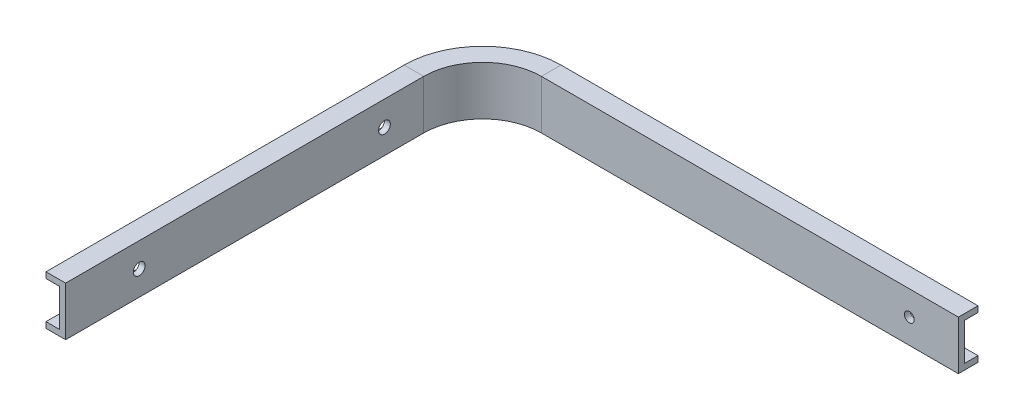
ISO-10303-21;
HEADER;
FILE_DESCRIPTION(('STEP AP214'),'2;1');
FILE_NAME('part.step','',(''),(''),'','','');
FILE_SCHEMA(('AUTOMOTIVE_DESIGN { 1 0 10303 214 1 1 1 1 }'));
ENDSEC;
DATA;
#1=APPLICATION_CONTEXT('core data for automotive mechanical design processes');
#2=APPLICATION_PROTOCOL_DEFINITION('international standard','automotive_design',2000,#1);
#3=PRODUCT_CONTEXT('',#1,'mechanical');
#4=PRODUCT('Part','Part','',(#3));
#5=PRODUCT_RELATED_PRODUCT_CATEGORY('part','',(#4));
#6=PRODUCT_DEFINITION_FORMATION('','',#4);
#7=PRODUCT_DEFINITION_CONTEXT('part definition',#1,'design');
#8=PRODUCT_DEFINITION('design','',#6,#7);
#9=PRODUCT_DEFINITION_SHAPE('','',#8);
#10=(LENGTH_UNIT() NAMED_UNIT(*) SI_UNIT(.MILLI.,.METRE.));
#11=(NAMED_UNIT(*) PLANE_ANGLE_UNIT() SI_UNIT($,.RADIAN.));
#12=(NAMED_UNIT(*) SI_UNIT($,.STERADIAN.) SOLID_ANGLE_UNIT());
#13=UNCERTAINTY_MEASURE_WITH_UNIT(LENGTH_MEASURE(1.E-05),#10,'distance_accuracy_value','');
#14=(GEOMETRIC_REPRESENTATION_CONTEXT(3) GLOBAL_UNCERTAINTY_ASSIGNED_CONTEXT((#13)) GLOBAL_UNIT_ASSIGNED_CONTEXT((#10,
#11,#12)) REPRESENTATION_CONTEXT('',''));
#15=CARTESIAN_POINT('',(0.,0.,0.));
#16=DIRECTION('',(0.,0.,1.));
#17=DIRECTION('',(1.,0.,0.));
#18=AXIS2_PLACEMENT_3D('',#15,#16,#17);
#19=CARTESIAN_POINT('',(-252.51106428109,-12.4999999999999,-227.488935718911));
#20=DIRECTION('',(-1.,0.,0.));
#21=DIRECTION('',(0.,0.,1.));
#22=AXIS2_PLACEMENT_3D('',#19,#20,#21);
#23=PLANE('',#22);
#24=DIRECTION('',(0.,-1.,0.));
#25=VECTOR('',#24,1.);
#26=CARTESIAN_POINT('',(-252.511064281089,12.5,222.511064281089));
#27=LINE('',#26,#25);
#28=CARTESIAN_POINT('',(-252.511064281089,-9.5,222.511064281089));
#29=VERTEX_POINT('',#28);
#30=CARTESIAN_POINT('',(-252.511064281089,-12.5,222.511064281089));
#31=VERTEX_POINT('',#30);
#32=EDGE_CURVE('E190',#29,#31,#27,.T.);
#33=ORIENTED_EDGE('',*,*,#32,.F.);
#34=DIRECTION('',(0.,0.,1.));
#35=VECTOR('',#34,1.);
#36=CARTESIAN_POINT('',(-252.511064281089,-9.5,40.0000000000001));
#37=LINE('',#36,#35);
#38=CARTESIAN_POINT('',(-252.511064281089,-9.5,40.0000000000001));
#39=VERTEX_POINT('',#38);
#40=EDGE_CURVE('E331',#39,#29,#37,.T.);
#41=ORIENTED_EDGE('',*,*,#40,.F.);
#42=DIRECTION('',(0.,-1.,0.));
#43=VECTOR('',#42,1.);
#44=CARTESIAN_POINT('',(-252.511064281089,-12.4999999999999,40.0000000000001));
#45=LINE('',#44,#43);
#46=CARTESIAN_POINT('',(-252.511064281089,-12.5,40.0000000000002));
#47=VERTEX_POINT('',#46);
#48=EDGE_CURVE('E43',#39,#47,#45,.T.);
#49=ORIENTED_EDGE('',*,*,#48,.T.);
#50=DIRECTION('',(0.,0.,-1.));
#51=VECTOR('',#50,1.);
#52=CARTESIAN_POINT('',(-252.51106428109,-12.4999999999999,-227.488935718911));
#53=LINE('',#52,#51);
#54=EDGE_CURVE('E189',#31,#47,#53,.T.);
#55=ORIENTED_EDGE('',*,*,#54,.F.);
#56=EDGE_LOOP('',(#33,#41,#49,#55));
#57=FACE_BOUND('',#56,.T.);
#58=ADVANCED_FACE('F34',(#57),#23,.T.);
#59=CARTESIAN_POINT('',(0.,-12.4999999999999,0.));
#60=DIRECTION('',(0.,0.,-1.));
#61=DIRECTION('',(-1.,0.,0.));
#62=AXIS2_PLACEMENT_3D('',#59,#60,#61);
#63=PLANE('',#62);
#64=DIRECTION('',(0.,-1.,0.));
#65=VECTOR('',#64,1.);
#66=CARTESIAN_POINT('',(-212.511064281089,-12.4999999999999,0.));
#67=LINE('',#66,#65);
#68=CARTESIAN_POINT('',(-212.511064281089,-9.50000000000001,0.));
#69=VERTEX_POINT('',#68);
#70=CARTESIAN_POINT('',(-212.511064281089,-12.5,0.));
#71=VERTEX_POINT('',#70);
#72=EDGE_CURVE('E165',#69,#71,#67,.T.);
#73=ORIENTED_EDGE('',*,*,#72,.F.);
#74=DIRECTION('',(-1.,0.,0.));
#75=VECTOR('',#74,1.);
#76=CARTESIAN_POINT('',(0.,-9.5,0.));
#77=LINE('',#76,#75);
#78=CARTESIAN_POINT('',(0.,-9.5,0.));
#79=VERTEX_POINT('',#78);
#80=EDGE_CURVE('E51',#79,#69,#77,.T.);
#81=ORIENTED_EDGE('',*,*,#80,.F.);
#82=DIRECTION('',(0.,1.,0.));
#83=VECTOR('',#82,1.);
#84=CARTESIAN_POINT('',(0.,12.4999999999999,0.));
#85=LINE('',#84,#83);
#86=CARTESIAN_POINT('',(0.,-12.4999999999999,0.));
#87=VERTEX_POINT('',#86);
#88=EDGE_CURVE('E164',#87,#79,#85,.T.);
#89=ORIENTED_EDGE('',*,*,#88,.F.);
#90=DIRECTION('',(1.,0.,0.));
#91=VECTOR('',#90,1.);
#92=CARTESIAN_POINT('',(0.,-12.4999999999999,0.));
#93=LINE('',#92,#91);
#94=EDGE_CURVE('E257',#71,#87,#93,.T.);
#95=ORIENTED_EDGE('',*,*,#94,.F.);
#96=EDGE_LOOP('',(#73,#81,#89,#95));
#97=FACE_BOUND('',#96,.T.);
#98=ADVANCED_FACE('F162',(#97),#63,.T.);
#99=CARTESIAN_POINT('',(-212.511064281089,463.304835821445,40.));
#100=DIRECTION('',(0.,-1.,0.));
#101=DIRECTION('',(0.,0.,-1.));
#102=AXIS2_PLACEMENT_3D('',#99,#100,#101);
#103=CYLINDRICAL_SURFACE('',#102,40.);
#104=ORIENTED_EDGE('',*,*,#48,.F.);
#105=CARTESIAN_POINT('',(-212.511064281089,-9.5,40.));
#106=DIRECTION('',(0.,1.,0.));
#107=DIRECTION('',(0.,0.,1.));
#108=AXIS2_PLACEMENT_3D('',#105,#106,#107);
#109=CIRCLE('',#108,40.);
#110=EDGE_CURVE('E166',#69,#39,#109,.T.);
#111=ORIENTED_EDGE('',*,*,#110,.F.);
#112=ORIENTED_EDGE('',*,*,#72,.T.);
#113=CARTESIAN_POINT('',(-212.511064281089,-12.5,40.));
#114=DIRECTION('',(0.,-1.,0.));
#115=DIRECTION('',(0.,0.,-1.));
#116=AXIS2_PLACEMENT_3D('',#113,#114,#115);
#117=CIRCLE('',#116,40.);
#118=EDGE_CURVE('E238',#47,#71,#117,.T.);
#119=ORIENTED_EDGE('',*,*,#118,.F.);
#120=EDGE_LOOP('',(#104,#111,#112,#119));
#121=FACE_BOUND('',#120,.T.);
#122=ADVANCED_FACE('F340',(#121),#103,.T.);
#123=CARTESIAN_POINT('',(-252.511064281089,0.,185.000000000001));
#124=DIRECTION('',(1.,0.,0.));
#125=DIRECTION('',(0.,0.,-1.));
#126=AXIS2_PLACEMENT_3D('',#123,#124,#125);
#127=CYLINDRICAL_SURFACE('',#126,2.99999999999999);
#128=CARTESIAN_POINT('',(-242.511064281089,0.,185.000000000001));
#129=DIRECTION('',(1.,0.,0.));
#130=DIRECTION('',(0.,0.,-1.));
#131=AXIS2_PLACEMENT_3D('',#128,#129,#130);
#132=CIRCLE('',#131,2.99999999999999);
#133=CARTESIAN_POINT('',(-242.511064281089,0.,182.000000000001));
#134=VERTEX_POINT('',#133);
#135=EDGE_CURVE('E234',#134,#134,#132,.T.);
#136=ORIENTED_EDGE('',*,*,#135,.T.);
#137=EDGE_LOOP('',(#136));
#138=FACE_BOUND('',#137,.T.);
#139=CARTESIAN_POINT('',(-245.511064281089,0.,185.000000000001));
#140=DIRECTION('',(-1.,0.,0.));
#141=DIRECTION('',(0.,0.,1.));
#142=AXIS2_PLACEMENT_3D('',#139,#140,#141);
#143=CIRCLE('',#142,2.99999999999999);
#144=CARTESIAN_POINT('',(-245.511064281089,0.,188.000000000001));
#145=VERTEX_POINT('',#144);
#146=EDGE_CURVE('E215',#145,#145,#143,.T.);
#147=ORIENTED_EDGE('',*,*,#146,.T.);
#148=EDGE_LOOP('',(#147));
#149=FACE_BOUND('',#148,.T.);
#150=ADVANCED_FACE('F392',(#138,#149),#127,.F.);
#151=CARTESIAN_POINT('',(-252.51106428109,0.,60.0000000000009));
#152=DIRECTION('',(1.,0.,0.));
#153=DIRECTION('',(0.,0.,-1.));
#154=AXIS2_PLACEMENT_3D('',#151,#152,#153);
#155=CYLINDRICAL_SURFACE('',#154,3.00000000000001);
#156=CARTESIAN_POINT('',(-242.51106428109,0.,60.0000000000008));
#157=DIRECTION('',(1.,0.,0.));
#158=DIRECTION('',(0.,0.,-1.));
#159=AXIS2_PLACEMENT_3D('',#156,#157,#158);
#160=CIRCLE('',#159,3.00000000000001);
#161=CARTESIAN_POINT('',(-242.51106428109,0.,57.0000000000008));
#162=VERTEX_POINT('',#161);
#163=EDGE_CURVE('E231',#162,#162,#160,.T.);
#164=ORIENTED_EDGE('',*,*,#163,.T.);
#165=EDGE_LOOP('',(#164));
#166=FACE_BOUND('',#165,.T.);
#167=CARTESIAN_POINT('',(-245.511064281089,0.,60.0000000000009));
#168=DIRECTION('',(-1.,0.,0.));
#169=DIRECTION('',(0.,0.,1.));
#170=AXIS2_PLACEMENT_3D('',#167,#168,#169);
#171=CIRCLE('',#170,3.00000000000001);
#172=CARTESIAN_POINT('',(-245.511064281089,0.,63.0000000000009));
#173=VERTEX_POINT('',#172);
#174=EDGE_CURVE('E38',#173,#173,#171,.T.);
#175=ORIENTED_EDGE('',*,*,#174,.T.);
#176=EDGE_LOOP('',(#175));
#177=FACE_BOUND('',#176,.T.);
#178=ADVANCED_FACE('F386',(#166,#177),#155,.F.);
#179=CARTESIAN_POINT('',(-25.,0.,0.));
#180=DIRECTION('',(0.,0.,1.));
#181=DIRECTION('',(1.,0.,0.));
#182=AXIS2_PLACEMENT_3D('',#179,#180,#181);
#183=CYLINDRICAL_SURFACE('',#182,2.5);
#184=CARTESIAN_POINT('',(-25.,0.,10.));
#185=DIRECTION('',(0.,0.,1.));
#186=DIRECTION('',(1.,0.,0.));
#187=AXIS2_PLACEMENT_3D('',#184,#185,#186);
#188=CIRCLE('',#187,2.5);
#189=CARTESIAN_POINT('',(-22.5,0.,10.));
#190=VERTEX_POINT('',#189);
#191=EDGE_CURVE('E228',#190,#190,#188,.T.);
#192=ORIENTED_EDGE('',*,*,#191,.T.);
#193=EDGE_LOOP('',(#192));
#194=FACE_BOUND('',#193,.T.);
#195=CARTESIAN_POINT('',(-25.,0.,7.));
#196=DIRECTION('',(0.,0.,-1.));
#197=DIRECTION('',(-1.,0.,0.));
#198=AXIS2_PLACEMENT_3D('',#195,#196,#197);
#199=CIRCLE('',#198,2.5);
#200=CARTESIAN_POINT('',(-27.5,0.,7.));
#201=VERTEX_POINT('',#200);
#202=EDGE_CURVE('E209',#201,#201,#199,.F.);
#203=ORIENTED_EDGE('',*,*,#202,.F.);
#204=EDGE_LOOP('',(#203));
#205=FACE_BOUND('',#204,.T.);
#206=ADVANCED_FACE('F380',(#194,#205),#183,.F.);
#207=DIRECTION('',(0.,0.,1.));
#208=VECTOR('',#207,1.);
#209=CARTESIAN_POINT('',(-252.511064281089,9.5,40.0000000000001));
#210=LINE('',#209,#208);
#211=CARTESIAN_POINT('',(-252.511064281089,9.5,40.0000000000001));
#212=VERTEX_POINT('',#211);
#213=CARTESIAN_POINT('',(-252.511064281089,9.5,222.511064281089));
#214=VERTEX_POINT('',#213);
#215=EDGE_CURVE('E297',#212,#214,#210,.T.);
#216=ORIENTED_EDGE('',*,*,#215,.T.);
#217=CARTESIAN_POINT('',(-252.511064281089,12.5,222.511064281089));
#218=VERTEX_POINT('',#217);
#219=EDGE_CURVE('E186',#218,#214,#27,.T.);
#220=ORIENTED_EDGE('',*,*,#219,.F.);
#221=DIRECTION('',(0.,0.,1.));
#222=VECTOR('',#221,1.);
#223=CARTESIAN_POINT('',(-252.51106428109,12.4999999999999,-227.488935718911));
#224=LINE('',#223,#222);
#225=CARTESIAN_POINT('',(-252.511064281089,12.5,40.0000000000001));
#226=VERTEX_POINT('',#225);
#227=EDGE_CURVE('E204',#226,#218,#224,.T.);
#228=ORIENTED_EDGE('',*,*,#227,.F.);
#229=EDGE_CURVE('E11',#226,#212,#45,.T.);
#230=ORIENTED_EDGE('',*,*,#229,.T.);
#231=EDGE_LOOP('',(#216,#220,#228,#230));
#232=FACE_BOUND('',#231,.T.);
#233=ADVANCED_FACE('F355',(#232),#23,.T.);
#234=CARTESIAN_POINT('',(-242.51106428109,-12.4999999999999,-227.488935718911));
#235=DIRECTION('',(-1.,0.,0.));
#236=DIRECTION('',(0.,0.,1.));
#237=AXIS2_PLACEMENT_3D('',#234,#235,#236);
#238=PLANE('',#237);
#239=ORIENTED_EDGE('',*,*,#135,.F.);
#240=EDGE_LOOP('',(#239));
#241=FACE_BOUND('',#240,.T.);
#242=DIRECTION('',(0.,-1.,0.));
#243=VECTOR('',#242,1.);
#244=CARTESIAN_POINT('',(-242.511064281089,-12.4999999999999,40.0000000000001));
#245=LINE('',#244,#243);
#246=CARTESIAN_POINT('',(-242.511064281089,12.5,40.0000000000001));
#247=VERTEX_POINT('',#246);
#248=CARTESIAN_POINT('',(-242.511064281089,-12.5,40.0000000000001));
#249=VERTEX_POINT('',#248);
#250=EDGE_CURVE('E201',#247,#249,#245,.T.);
#251=ORIENTED_EDGE('',*,*,#250,.F.);
#252=DIRECTION('',(0.,0.,1.));
#253=VECTOR('',#252,1.);
#254=CARTESIAN_POINT('',(-242.51106428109,12.4999999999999,-227.488935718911));
#255=LINE('',#254,#253);
#256=CARTESIAN_POINT('',(-242.511064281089,12.5,222.511064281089));
#257=VERTEX_POINT('',#256);
#258=EDGE_CURVE('E185',#247,#257,#255,.T.);
#259=ORIENTED_EDGE('',*,*,#258,.T.);
#260=DIRECTION('',(0.,-1.,0.));
#261=VECTOR('',#260,1.);
#262=CARTESIAN_POINT('',(-242.511064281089,12.5,222.511064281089));
#263=LINE('',#262,#261);
#264=CARTESIAN_POINT('',(-242.511064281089,-12.5,222.511064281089));
#265=VERTEX_POINT('',#264);
#266=EDGE_CURVE('E182',#257,#265,#263,.T.);
#267=ORIENTED_EDGE('',*,*,#266,.T.);
#268=DIRECTION('',(0.,0.,-1.));
#269=VECTOR('',#268,1.);
#270=CARTESIAN_POINT('',(-242.51106428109,-12.4999999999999,-227.488935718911));
#271=LINE('',#270,#269);
#272=EDGE_CURVE('E184',#265,#249,#271,.T.);
#273=ORIENTED_EDGE('',*,*,#272,.T.);
#274=EDGE_LOOP('',(#251,#259,#267,#273));
#275=FACE_BOUND('',#274,.T.);
#276=ORIENTED_EDGE('',*,*,#163,.F.);
#277=EDGE_LOOP('',(#276));
#278=FACE_BOUND('',#277,.T.);
#279=ADVANCED_FACE('F361',(#241,#275,#278),#238,.F.);
#280=CARTESIAN_POINT('',(-242.51106428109,12.4999999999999,-227.488935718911));
#281=DIRECTION('',(0.,-1.,0.));
#282=DIRECTION('',(0.,0.,-1.));
#283=AXIS2_PLACEMENT_3D('',#280,#281,#282);
#284=PLANE('',#283);
#285=DIRECTION('',(1.,0.,0.));
#286=VECTOR('',#285,1.);
#287=CARTESIAN_POINT('',(-242.511064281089,12.5,40.0000000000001));
#288=LINE('',#287,#286);
#289=EDGE_CURVE('E197',#226,#247,#288,.T.);
#290=ORIENTED_EDGE('',*,*,#289,.F.);
#291=ORIENTED_EDGE('',*,*,#227,.T.);
#292=DIRECTION('',(-1.,0.,0.));
#293=VECTOR('',#292,1.);
#294=CARTESIAN_POINT('',(-242.511064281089,12.5,222.511064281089));
#295=LINE('',#294,#293);
#296=EDGE_CURVE('E194',#257,#218,#295,.T.);
#297=ORIENTED_EDGE('',*,*,#296,.F.);
#298=ORIENTED_EDGE('',*,*,#258,.F.);
#299=EDGE_LOOP('',(#290,#291,#297,#298));
#300=FACE_BOUND('',#299,.T.);
#301=ADVANCED_FACE('F36',(#300),#284,.F.);
#302=CARTESIAN_POINT('',(-242.511064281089,12.5,222.511064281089));
#303=DIRECTION('',(0.,0.,-1.));
#304=DIRECTION('',(-1.,0.,0.));
#305=AXIS2_PLACEMENT_3D('',#302,#303,#304);
#306=PLANE('',#305);
#307=ORIENTED_EDGE('',*,*,#219,.T.);
#308=DIRECTION('',(1.,0.,0.));
#309=VECTOR('',#308,1.);
#310=CARTESIAN_POINT('',(-252.511064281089,9.5,222.511064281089));
#311=LINE('',#310,#309);
#312=CARTESIAN_POINT('',(-245.511064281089,9.5,222.511064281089));
#313=VERTEX_POINT('',#312);
#314=EDGE_CURVE('E304',#214,#313,#311,.T.);
#315=ORIENTED_EDGE('',*,*,#314,.T.);
#316=DIRECTION('',(0.,-1.,0.));
#317=VECTOR('',#316,1.);
#318=CARTESIAN_POINT('',(-245.511064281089,9.5,222.511064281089));
#319=LINE('',#318,#317);
#320=CARTESIAN_POINT('',(-245.511064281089,-9.5,222.511064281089));
#321=VERTEX_POINT('',#320);
#322=EDGE_CURVE('E211',#313,#321,#319,.T.);
#323=ORIENTED_EDGE('',*,*,#322,.T.);
#324=DIRECTION('',(1.,0.,0.));
#325=VECTOR('',#324,1.);
#326=CARTESIAN_POINT('',(-252.511064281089,-9.5,222.511064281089));
#327=LINE('',#326,#325);
#328=EDGE_CURVE('E329',#29,#321,#327,.T.);
#329=ORIENTED_EDGE('',*,*,#328,.F.);
#330=ORIENTED_EDGE('',*,*,#32,.T.);
#331=DIRECTION('',(-1.,0.,0.));
#332=VECTOR('',#331,1.);
#333=CARTESIAN_POINT('',(-242.511064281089,-12.5,222.511064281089));
#334=LINE('',#333,#332);
#335=EDGE_CURVE('E191',#265,#31,#334,.T.);
#336=ORIENTED_EDGE('',*,*,#335,.F.);
#337=ORIENTED_EDGE('',*,*,#266,.F.);
#338=ORIENTED_EDGE('',*,*,#296,.T.);
#339=EDGE_LOOP('',(#307,#315,#323,#329,#330,#336,#337,#338));
#340=FACE_BOUND('',#339,.T.);
#341=ADVANCED_FACE('F349',(#340),#306,.F.);
#342=CARTESIAN_POINT('',(-242.51106428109,-12.4999999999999,-227.488935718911));
#343=DIRECTION('',(0.,1.,0.));
#344=DIRECTION('',(0.,0.,1.));
#345=AXIS2_PLACEMENT_3D('',#342,#343,#344);
#346=PLANE('',#345);
#347=DIRECTION('',(-1.,0.,0.));
#348=VECTOR('',#347,1.);
#349=CARTESIAN_POINT('',(-242.511064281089,-12.5,40.0000000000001));
#350=LINE('',#349,#348);
#351=EDGE_CURVE('E59',#249,#47,#350,.T.);
#352=ORIENTED_EDGE('',*,*,#351,.F.);
#353=ORIENTED_EDGE('',*,*,#272,.F.);
#354=ORIENTED_EDGE('',*,*,#335,.T.);
#355=ORIENTED_EDGE('',*,*,#54,.T.);
#356=EDGE_LOOP('',(#352,#353,#354,#355));
#357=FACE_BOUND('',#356,.T.);
#358=ADVANCED_FACE('F364',(#357),#346,.F.);
#359=CARTESIAN_POINT('',(0.,12.4999999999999,10.));
#360=DIRECTION('',(-1.,0.,0.));
#361=DIRECTION('',(0.,0.,1.));
#362=AXIS2_PLACEMENT_3D('',#359,#360,#361);
#363=PLANE('',#362);
#364=DIRECTION('',(0.,-1.,0.));
#365=VECTOR('',#364,1.);
#366=CARTESIAN_POINT('',(0.,9.5,7.));
#367=LINE('',#366,#365);
#368=CARTESIAN_POINT('',(0.,9.5,7.));
#369=VERTEX_POINT('',#368);
#370=CARTESIAN_POINT('',(0.,-9.5,7.));
#371=VERTEX_POINT('',#370);
#372=EDGE_CURVE('E312',#369,#371,#367,.T.);
#373=ORIENTED_EDGE('',*,*,#372,.F.);
#374=DIRECTION('',(0.,0.,-1.));
#375=VECTOR('',#374,1.);
#376=CARTESIAN_POINT('',(0.,9.5,0.));
#377=LINE('',#376,#375);
#378=CARTESIAN_POINT('',(0.,9.5,0.));
#379=VERTEX_POINT('',#378);
#380=EDGE_CURVE('E295',#369,#379,#377,.T.);
#381=ORIENTED_EDGE('',*,*,#380,.T.);
#382=CARTESIAN_POINT('',(0.,12.4999999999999,0.));
#383=VERTEX_POINT('',#382);
#384=EDGE_CURVE('E173',#379,#383,#85,.T.);
#385=ORIENTED_EDGE('',*,*,#384,.T.);
#386=DIRECTION('',(0.,0.,-1.));
#387=VECTOR('',#386,1.);
#388=CARTESIAN_POINT('',(0.,12.4999999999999,10.));
#389=LINE('',#388,#387);
#390=CARTESIAN_POINT('',(0.,12.4999999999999,10.));
#391=VERTEX_POINT('',#390);
#392=EDGE_CURVE('E206',#391,#383,#389,.T.);
#393=ORIENTED_EDGE('',*,*,#392,.F.);
#394=DIRECTION('',(0.,1.,0.));
#395=VECTOR('',#394,1.);
#396=CARTESIAN_POINT('',(0.,12.4999999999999,10.));
#397=LINE('',#396,#395);
#398=CARTESIAN_POINT('',(0.,-12.4999999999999,10.));
#399=VERTEX_POINT('',#398);
#400=EDGE_CURVE('E262',#399,#391,#397,.T.);
#401=ORIENTED_EDGE('',*,*,#400,.F.);
#402=DIRECTION('',(0.,0.,-1.));
#403=VECTOR('',#402,1.);
#404=CARTESIAN_POINT('',(0.,-12.4999999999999,10.));
#405=LINE('',#404,#403);
#406=EDGE_CURVE('E172',#399,#87,#405,.T.);
#407=ORIENTED_EDGE('',*,*,#406,.T.);
#408=ORIENTED_EDGE('',*,*,#88,.T.);
#409=DIRECTION('',(0.,0.,-1.));
#410=VECTOR('',#409,1.);
#411=CARTESIAN_POINT('',(0.,-9.5,0.));
#412=LINE('',#411,#410);
#413=EDGE_CURVE('E150',#371,#79,#412,.T.);
#414=ORIENTED_EDGE('',*,*,#413,.F.);
#415=EDGE_LOOP('',(#373,#381,#385,#393,#401,#407,#408,#414));
#416=FACE_BOUND('',#415,.T.);
#417=ADVANCED_FACE('F169',(#416),#363,.F.);
#418=CARTESIAN_POINT('',(0.,-12.4999999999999,10.));
#419=DIRECTION('',(0.,0.,-1.));
#420=DIRECTION('',(-1.,0.,0.));
#421=AXIS2_PLACEMENT_3D('',#418,#419,#420);
#422=PLANE('',#421);
#423=ORIENTED_EDGE('',*,*,#191,.F.);
#424=EDGE_LOOP('',(#423));
#425=FACE_BOUND('',#424,.T.);
#426=DIRECTION('',(-1.,0.,0.));
#427=VECTOR('',#426,1.);
#428=CARTESIAN_POINT('',(0.,12.4999999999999,10.));
#429=LINE('',#428,#427);
#430=CARTESIAN_POINT('',(-212.511064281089,12.5,9.99999999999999));
#431=VERTEX_POINT('',#430);
#432=EDGE_CURVE('E175',#391,#431,#429,.T.);
#433=ORIENTED_EDGE('',*,*,#432,.T.);
#434=DIRECTION('',(0.,-1.,0.));
#435=VECTOR('',#434,1.);
#436=CARTESIAN_POINT('',(-212.511064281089,-12.4999999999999,10.));
#437=LINE('',#436,#435);
#438=CARTESIAN_POINT('',(-212.511064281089,-12.5,9.99999999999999));
#439=VERTEX_POINT('',#438);
#440=EDGE_CURVE('E267',#431,#439,#437,.T.);
#441=ORIENTED_EDGE('',*,*,#440,.T.);
#442=DIRECTION('',(1.,0.,0.));
#443=VECTOR('',#442,1.);
#444=CARTESIAN_POINT('',(0.,-12.4999999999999,10.));
#445=LINE('',#444,#443);
#446=EDGE_CURVE('E265',#439,#399,#445,.T.);
#447=ORIENTED_EDGE('',*,*,#446,.T.);
#448=ORIENTED_EDGE('',*,*,#400,.T.);
#449=EDGE_LOOP('',(#433,#441,#447,#448));
#450=FACE_BOUND('',#449,.T.);
#451=ADVANCED_FACE('F271',(#425,#450),#422,.F.);
#452=CARTESIAN_POINT('',(0.,-12.4999999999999,10.));
#453=DIRECTION('',(0.,1.,0.));
#454=DIRECTION('',(-1.,0.,0.));
#455=AXIS2_PLACEMENT_3D('',#452,#453,#454);
#456=PLANE('',#455);
#457=ORIENTED_EDGE('',*,*,#446,.F.);
#458=DIRECTION('',(0.,0.,-1.));
#459=VECTOR('',#458,1.);
#460=CARTESIAN_POINT('',(-212.511064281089,-12.5,10.));
#461=LINE('',#460,#459);
#462=EDGE_CURVE('E259',#439,#71,#461,.T.);
#463=ORIENTED_EDGE('',*,*,#462,.T.);
#464=ORIENTED_EDGE('',*,*,#94,.T.);
#465=ORIENTED_EDGE('',*,*,#406,.F.);
#466=EDGE_LOOP('',(#457,#463,#464,#465));
#467=FACE_BOUND('',#466,.T.);
#468=ADVANCED_FACE('F345',(#467),#456,.F.);
#469=DIRECTION('',(-1.,0.,0.));
#470=VECTOR('',#469,1.);
#471=CARTESIAN_POINT('',(0.,9.5,0.));
#472=LINE('',#471,#470);
#473=CARTESIAN_POINT('',(-212.511064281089,9.5,0.));
#474=VERTEX_POINT('',#473);
#475=EDGE_CURVE('E290',#379,#474,#472,.T.);
#476=ORIENTED_EDGE('',*,*,#475,.T.);
#477=CARTESIAN_POINT('',(-212.511064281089,12.5,0.));
#478=VERTEX_POINT('',#477);
#479=EDGE_CURVE('E177',#478,#474,#67,.T.);
#480=ORIENTED_EDGE('',*,*,#479,.F.);
#481=DIRECTION('',(-1.,0.,0.));
#482=VECTOR('',#481,1.);
#483=CARTESIAN_POINT('',(0.,12.4999999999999,0.));
#484=LINE('',#483,#482);
#485=EDGE_CURVE('E254',#383,#478,#484,.T.);
#486=ORIENTED_EDGE('',*,*,#485,.F.);
#487=ORIENTED_EDGE('',*,*,#384,.F.);
#488=EDGE_LOOP('',(#476,#480,#486,#487));
#489=FACE_BOUND('',#488,.T.);
#490=ADVANCED_FACE('F288',(#489),#63,.T.);
#491=CARTESIAN_POINT('',(0.,12.4999999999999,10.));
#492=DIRECTION('',(0.,-1.,0.));
#493=DIRECTION('',(1.,0.,0.));
#494=AXIS2_PLACEMENT_3D('',#491,#492,#493);
#495=PLANE('',#494);
#496=ORIENTED_EDGE('',*,*,#485,.T.);
#497=DIRECTION('',(0.,0.,1.));
#498=VECTOR('',#497,1.);
#499=CARTESIAN_POINT('',(-212.511064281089,12.5,10.));
#500=LINE('',#499,#498);
#501=EDGE_CURVE('E251',#478,#431,#500,.T.);
#502=ORIENTED_EDGE('',*,*,#501,.T.);
#503=ORIENTED_EDGE('',*,*,#432,.F.);
#504=ORIENTED_EDGE('',*,*,#392,.T.);
#505=EDGE_LOOP('',(#496,#502,#503,#504));
#506=FACE_BOUND('',#505,.T.);
#507=ADVANCED_FACE('F275',(#506),#495,.F.);
#508=CARTESIAN_POINT('',(-212.511064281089,12.5,40.));
#509=DIRECTION('',(0.,-1.,0.));
#510=DIRECTION('',(1.,0.,0.));
#511=AXIS2_PLACEMENT_3D('',#508,#509,#510);
#512=PLANE('',#511);
#513=ORIENTED_EDGE('',*,*,#289,.T.);
#514=CARTESIAN_POINT('',(-212.511064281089,12.5,40.));
#515=DIRECTION('',(0.,-1.,0.));
#516=DIRECTION('',(0.,0.,-1.));
#517=AXIS2_PLACEMENT_3D('',#514,#515,#516);
#518=CIRCLE('',#517,30.);
#519=EDGE_CURVE('E237',#431,#247,#518,.F.);
#520=ORIENTED_EDGE('',*,*,#519,.F.);
#521=ORIENTED_EDGE('',*,*,#501,.F.);
#522=CARTESIAN_POINT('',(-212.511064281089,12.5,40.));
#523=DIRECTION('',(0.,-1.,0.));
#524=DIRECTION('',(0.,0.,-1.));
#525=AXIS2_PLACEMENT_3D('',#522,#523,#524);
#526=CIRCLE('',#525,40.);
#527=EDGE_CURVE('E241',#478,#226,#526,.F.);
#528=ORIENTED_EDGE('',*,*,#527,.T.);
#529=EDGE_LOOP('',(#513,#520,#521,#528));
#530=FACE_BOUND('',#529,.T.);
#531=ADVANCED_FACE('F280',(#530),#512,.F.);
#532=CARTESIAN_POINT('',(-212.511064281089,-12.5,40.));
#533=DIRECTION('',(0.,1.,0.));
#534=DIRECTION('',(-1.,0.,0.));
#535=AXIS2_PLACEMENT_3D('',#532,#533,#534);
#536=PLANE('',#535);
#537=ORIENTED_EDGE('',*,*,#462,.F.);
#538=CARTESIAN_POINT('',(-212.511064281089,-12.5,40.));
#539=DIRECTION('',(0.,-1.,0.));
#540=DIRECTION('',(0.,0.,-1.));
#541=AXIS2_PLACEMENT_3D('',#538,#539,#540);
#542=CIRCLE('',#541,30.);
#543=EDGE_CURVE('E244',#249,#439,#542,.T.);
#544=ORIENTED_EDGE('',*,*,#543,.F.);
#545=ORIENTED_EDGE('',*,*,#351,.T.);
#546=ORIENTED_EDGE('',*,*,#118,.T.);
#547=EDGE_LOOP('',(#537,#544,#545,#546));
#548=FACE_BOUND('',#547,.T.);
#549=ADVANCED_FACE('F342',(#548),#536,.F.);
#550=CARTESIAN_POINT('',(-212.511064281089,9.5,40.));
#551=DIRECTION('',(0.,1.,0.));
#552=DIRECTION('',(0.,0.,1.));
#553=AXIS2_PLACEMENT_3D('',#550,#551,#552);
#554=CIRCLE('',#553,40.);
#555=EDGE_CURVE('E294',#474,#212,#554,.T.);
#556=ORIENTED_EDGE('',*,*,#555,.T.);
#557=ORIENTED_EDGE('',*,*,#229,.F.);
#558=ORIENTED_EDGE('',*,*,#527,.F.);
#559=ORIENTED_EDGE('',*,*,#479,.T.);
#560=EDGE_LOOP('',(#556,#557,#558,#559));
#561=FACE_BOUND('',#560,.T.);
#562=ADVANCED_FACE('F285',(#561),#103,.T.);
#563=CARTESIAN_POINT('',(-212.511064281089,463.304835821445,40.));
#564=DIRECTION('',(0.,-1.,0.));
#565=DIRECTION('',(0.,0.,-1.));
#566=AXIS2_PLACEMENT_3D('',#563,#564,#565);
#567=CYLINDRICAL_SURFACE('',#566,30.);
#568=ORIENTED_EDGE('',*,*,#543,.T.);
#569=ORIENTED_EDGE('',*,*,#440,.F.);
#570=ORIENTED_EDGE('',*,*,#519,.T.);
#571=ORIENTED_EDGE('',*,*,#250,.T.);
#572=EDGE_LOOP('',(#568,#569,#570,#571));
#573=FACE_BOUND('',#572,.T.);
#574=ADVANCED_FACE('F359',(#573),#567,.F.);
#575=CARTESIAN_POINT('',(0.,9.5,7.));
#576=DIRECTION('',(0.,0.,-1.));
#577=DIRECTION('',(-1.,0.,0.));
#578=AXIS2_PLACEMENT_3D('',#575,#576,#577);
#579=PLANE('',#578);
#580=DIRECTION('',(0.,-1.,0.));
#581=VECTOR('',#580,1.);
#582=CARTESIAN_POINT('',(-212.511064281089,9.5,7.));
#583=LINE('',#582,#581);
#584=CARTESIAN_POINT('',(-212.511064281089,9.5,7.));
#585=VERTEX_POINT('',#584);
#586=CARTESIAN_POINT('',(-212.511064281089,-9.5,7.));
#587=VERTEX_POINT('',#586);
#588=EDGE_CURVE('E222',#585,#587,#583,.T.);
#589=ORIENTED_EDGE('',*,*,#588,.F.);
#590=DIRECTION('',(1.,0.,0.));
#591=VECTOR('',#590,1.);
#592=CARTESIAN_POINT('',(0.,9.5,7.));
#593=LINE('',#592,#591);
#594=EDGE_CURVE('E310',#585,#369,#593,.T.);
#595=ORIENTED_EDGE('',*,*,#594,.T.);
#596=ORIENTED_EDGE('',*,*,#372,.T.);
#597=DIRECTION('',(1.,0.,0.));
#598=VECTOR('',#597,1.);
#599=CARTESIAN_POINT('',(0.,-9.5,7.));
#600=LINE('',#599,#598);
#601=EDGE_CURVE('E154',#587,#371,#600,.T.);
#602=ORIENTED_EDGE('',*,*,#601,.F.);
#603=EDGE_LOOP('',(#589,#595,#596,#602));
#604=FACE_BOUND('',#603,.T.);
#605=ORIENTED_EDGE('',*,*,#202,.T.);
#606=EDGE_LOOP('',(#605));
#607=FACE_BOUND('',#606,.T.);
#608=ADVANCED_FACE('F326',(#604,#607),#579,.T.);
#609=CARTESIAN_POINT('',(-245.511064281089,9.5,40.0000000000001));
#610=DIRECTION('',(-1.,0.,0.));
#611=DIRECTION('',(0.,0.,1.));
#612=AXIS2_PLACEMENT_3D('',#609,#610,#611);
#613=PLANE('',#612);
#614=ORIENTED_EDGE('',*,*,#146,.F.);
#615=EDGE_LOOP('',(#614));
#616=FACE_BOUND('',#615,.T.);
#617=ORIENTED_EDGE('',*,*,#174,.F.);
#618=EDGE_LOOP('',(#617));
#619=FACE_BOUND('',#618,.T.);
#620=ORIENTED_EDGE('',*,*,#322,.F.);
#621=DIRECTION('',(0.,0.,-1.));
#622=VECTOR('',#621,1.);
#623=CARTESIAN_POINT('',(-245.511064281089,9.5,40.0000000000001));
#624=LINE('',#623,#622);
#625=CARTESIAN_POINT('',(-245.511064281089,9.5,40.0000000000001));
#626=VERTEX_POINT('',#625);
#627=EDGE_CURVE('E306',#313,#626,#624,.T.);
#628=ORIENTED_EDGE('',*,*,#627,.T.);
#629=DIRECTION('',(0.,-1.,0.));
#630=VECTOR('',#629,1.);
#631=CARTESIAN_POINT('',(-245.511064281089,9.5,40.0000000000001));
#632=LINE('',#631,#630);
#633=CARTESIAN_POINT('',(-245.511064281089,-9.5,40.0000000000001));
#634=VERTEX_POINT('',#633);
#635=EDGE_CURVE('E217',#626,#634,#632,.T.);
#636=ORIENTED_EDGE('',*,*,#635,.T.);
#637=DIRECTION('',(0.,0.,-1.));
#638=VECTOR('',#637,1.);
#639=CARTESIAN_POINT('',(-245.511064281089,-9.5,40.0000000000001));
#640=LINE('',#639,#638);
#641=EDGE_CURVE('E324',#321,#634,#640,.T.);
#642=ORIENTED_EDGE('',*,*,#641,.F.);
#643=EDGE_LOOP('',(#620,#628,#636,#642));
#644=FACE_BOUND('',#643,.T.);
#645=ADVANCED_FACE('F397',(#616,#619,#644),#613,.T.);
#646=CARTESIAN_POINT('',(-212.511064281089,9.5,40.));
#647=DIRECTION('',(0.,-1.,0.));
#648=DIRECTION('',(0.,0.,-1.));
#649=AXIS2_PLACEMENT_3D('',#646,#647,#648);
#650=CYLINDRICAL_SURFACE('',#649,33.);
#651=ORIENTED_EDGE('',*,*,#635,.F.);
#652=CARTESIAN_POINT('',(-212.511064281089,9.5,40.));
#653=DIRECTION('',(0.,-1.,0.));
#654=DIRECTION('',(0.,0.,1.));
#655=AXIS2_PLACEMENT_3D('',#652,#653,#654);
#656=CIRCLE('',#655,33.);
#657=EDGE_CURVE('E308',#626,#585,#656,.T.);
#658=ORIENTED_EDGE('',*,*,#657,.T.);
#659=ORIENTED_EDGE('',*,*,#588,.T.);
#660=CARTESIAN_POINT('',(-212.511064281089,-9.5,40.));
#661=DIRECTION('',(0.,-1.,0.));
#662=DIRECTION('',(0.,0.,1.));
#663=AXIS2_PLACEMENT_3D('',#660,#661,#662);
#664=CIRCLE('',#663,33.);
#665=EDGE_CURVE('E318',#634,#587,#664,.T.);
#666=ORIENTED_EDGE('',*,*,#665,.F.);
#667=EDGE_LOOP('',(#651,#658,#659,#666));
#668=FACE_BOUND('',#667,.T.);
#669=ADVANCED_FACE('F317',(#668),#650,.T.);
#670=CARTESIAN_POINT('',(-212.511064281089,9.5,40.));
#671=DIRECTION('',(0.,1.,0.));
#672=DIRECTION('',(0.,0.,1.));
#673=AXIS2_PLACEMENT_3D('',#670,#671,#672);
#674=PLANE('',#673);
#675=ORIENTED_EDGE('',*,*,#380,.F.);
#676=ORIENTED_EDGE('',*,*,#594,.F.);
#677=ORIENTED_EDGE('',*,*,#657,.F.);
#678=ORIENTED_EDGE('',*,*,#627,.F.);
#679=ORIENTED_EDGE('',*,*,#314,.F.);
#680=ORIENTED_EDGE('',*,*,#215,.F.);
#681=ORIENTED_EDGE('',*,*,#555,.F.);
#682=ORIENTED_EDGE('',*,*,#475,.F.);
#683=EDGE_LOOP('',(#675,#676,#677,#678,#679,#680,#681,#682));
#684=FACE_BOUND('',#683,.T.);
#685=ADVANCED_FACE('F346',(#684),#674,.F.);
#686=CARTESIAN_POINT('',(-212.511064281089,-9.5,40.));
#687=DIRECTION('',(0.,1.,0.));
#688=DIRECTION('',(0.,0.,1.));
#689=AXIS2_PLACEMENT_3D('',#686,#687,#688);
#690=PLANE('',#689);
#691=ORIENTED_EDGE('',*,*,#413,.T.);
#692=ORIENTED_EDGE('',*,*,#80,.T.);
#693=ORIENTED_EDGE('',*,*,#110,.T.);
#694=ORIENTED_EDGE('',*,*,#40,.T.);
#695=ORIENTED_EDGE('',*,*,#328,.T.);
#696=ORIENTED_EDGE('',*,*,#641,.T.);
#697=ORIENTED_EDGE('',*,*,#665,.T.);
#698=ORIENTED_EDGE('',*,*,#601,.T.);
#699=EDGE_LOOP('',(#691,#692,#693,#694,#695,#696,#697,#698));
#700=FACE_BOUND('',#699,.T.);
#701=ADVANCED_FACE('F151',(#700),#690,.T.);
#702=CLOSED_SHELL('',(#58,#98,#122,#150,#178,#206,#233,#279,#301,#341,#358,#417,#451,#468,#490,
#507,#531,#549,#562,#574,#608,#645,#669,#685,#701));
#703=MANIFOLD_SOLID_BREP('B2',#702);
#704=ADVANCED_BREP_SHAPE_REPRESENTATION('',(#18,#703),#14);
#705=SHAPE_DEFINITION_REPRESENTATION(#9,#704);
ENDSEC;
END-ISO-10303-21;
